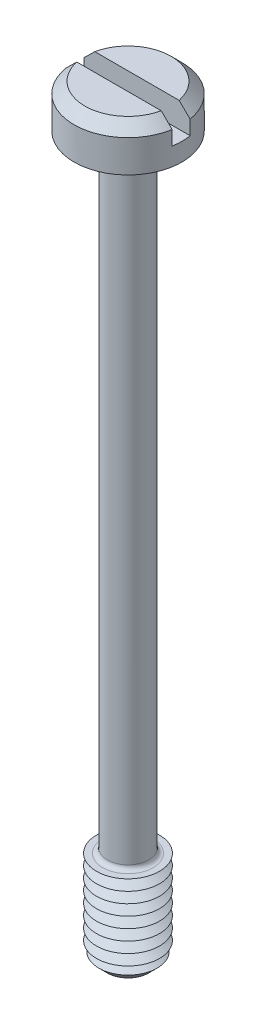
from build123d import *

# Parameters (mm, degrees)
SKETCH1_R           = 3
BOSS_EXTRUDE1_DEPTH = 2.4
SKETCH2_R           = 1.15
BOSS_EXTRUDE2_DEPTH = 40
SKETCH3_R           = 1.75
BOSS_EXTRUDE3_DEPTH = 5.2
CHAMFER1_SIZE       = 0.6
LPATTERN1_COUNT     = 8
LPATTERN1_PITCH     = 0.6
FILLET1_R           = 0.25
CHAMFER2_SIZE       = 0.6
SKETCH6_W           = 6
SKETCH6_H           = 1
CUT_EXTRUDE1_DEPTH  = 1.4


with BuildPart() as part:
    # Sketch1 → Boss-Extrude1 (new body)
    with BuildSketch(Plane(origin=(0, 0, 0), x_dir=(1, 0, 0), z_dir=(0, 1, 0))):
        with Locations(Location((0, 0, 0), (0, 0, 270))):
            Circle(SKETCH1_R)
    extrude(amount=BOSS_EXTRUDE1_DEPTH)

    # Sketch2 → Boss-Extrude2 (add)
    with BuildSketch(Plane.XZ):
        with Locations(Location((0, 0, 0), (0, 0, 270))):
            Circle(SKETCH2_R)
    extrude(amount=BOSS_EXTRUDE2_DEPTH)

    # Sketch3 → Boss-Extrude3 (add)
    with BuildSketch(Plane.XZ.offset(40)):
        with Locations(Location((0, 0, 0), (0, 0, 270))):
            Circle(SKETCH3_R)
    extrude(amount=-BOSS_EXTRUDE3_DEPTH)

    # Chamfer1
    chamfer1_edges = [part.edges().sort_by_distance(p)[0] for p in [
        (0, -40, 1.75),
    ]]
    chamfer(chamfer1_edges, length=CHAMFER1_SIZE)

    # Sketch5 → Cut-Revolve1 (revolve, cut)
    with BuildSketch(Plane(origin=(0, 0, 0), x_dir=(0, 0, -1), z_dir=(1, 0, 0))):
        Polygon((-1.75, -34.8), (-1.230384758, -35.1), (-1.75, -35.4), align=None)
    cut_revolve1 = revolve(axis=Axis((0, -6.58711856, 0), (0, -1, 0)), mode=Mode.SUBTRACT)

    # LPattern1: Cut-Revolve1 ×8
    with Locations(*[(0, -i * LPATTERN1_PITCH, 0) for i in range(1, LPATTERN1_COUNT)]):
        add(cut_revolve1, mode=Mode.SUBTRACT)

    # Fillet1
    fillet1_edges = [part.edges().sort_by_distance(p)[0] for p in [
        (0, 0, 1.15),
        (0, -34.8, 1.15),
    ]]
    fillet(fillet1_edges, radius=FILLET1_R)

    # Chamfer2
    chamfer2_edges = [part.edges().sort_by_distance(p)[0] for p in [
        (0, 2.4, -3),
    ]]
    chamfer(chamfer2_edges, length=CHAMFER2_SIZE)

    # Sketch6 → Cut-Extrude1 (cut)
    with BuildSketch(Plane(origin=(0, 2.4, 0), x_dir=(1, 0, 0), z_dir=(0, 1, 0))):
        Rectangle(SKETCH6_W, SKETCH6_H)
    extrude(amount=-CUT_EXTRUDE1_DEPTH, mode=Mode.SUBTRACT)


solid = part.part
